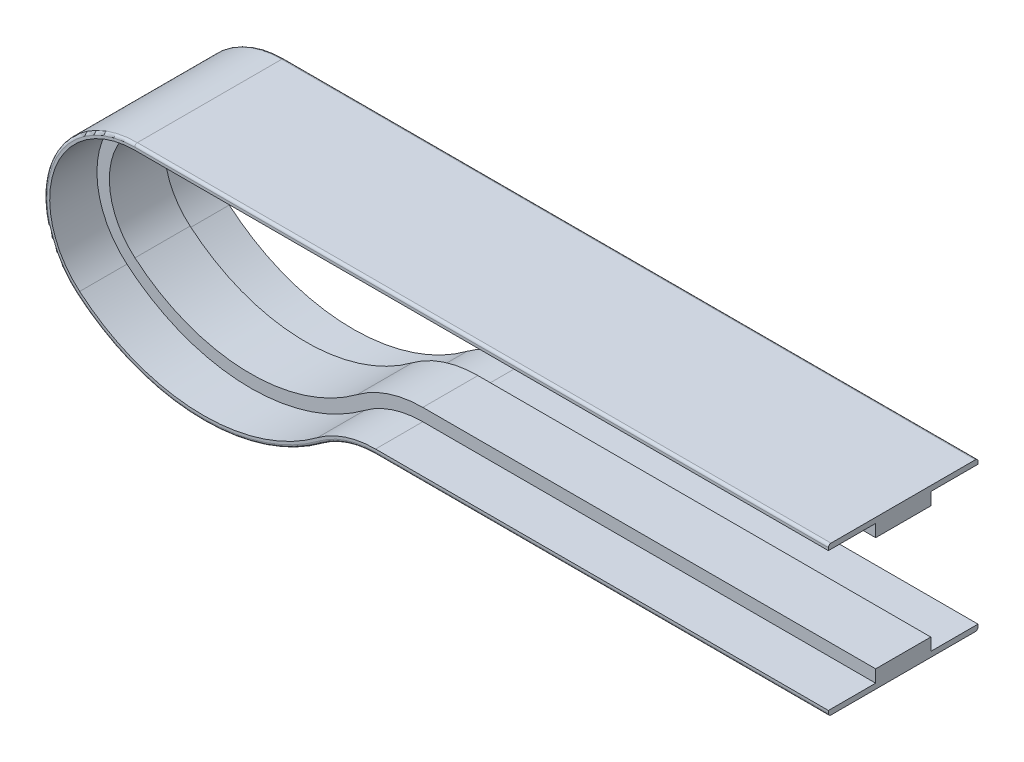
from build123d import *


with BuildPart() as part:
    # Balayage1: sweep along a path in Esquisse1
    with BuildLine(Plane.XY) as balayage1_path:
        Line((0, 0), (-530, 0))
        ThreePointArc((-530, 0), (-594.763390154, -45.194469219), (-574.687735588, -121.573817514))
        ThreePointArc((-574.687735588, -121.573817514), (-482.436483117, -157.202985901), (-388.05716165, -127.66868547))
        ThreePointArc((-388.05716165, -127.66868547), (-368.150251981, -117.320063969), (-346, -113.75))
        Line((-346, -113.75), (0, -113.75))
    # Esquisse2 → Balayage1 (sweep)
    with BuildSketch(Plane(origin=(0, 0, 0), x_dir=(0, 0, -1), z_dir=(1, 0, 0))):
        with BuildLine():
            Line((-55.15, 0), (55.15, 0))
            ThreePointArc((55.15, 0), (56.564213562, -0.585786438), (57.15, -2))
            Line((57.15, -2), (57.15, -4))
            Line((57.15, -4), (21.05, -4))
            Line((21.05, -4), (21.05, -13.5))
            Line((21.05, -13.5), (-21.05, -13.5))
            Line((-21.05, -13.5), (-21.05, -4))
            Line((-21.05, -4), (-57.15, -4))
            Line((-57.15, -4), (-57.15, -2))
            ThreePointArc((-57.15, -2), (-56.564213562, -0.585786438), (-55.15, 0))
        make_face()
    sweep(path=balayage1_path.line)


solid = part.part
